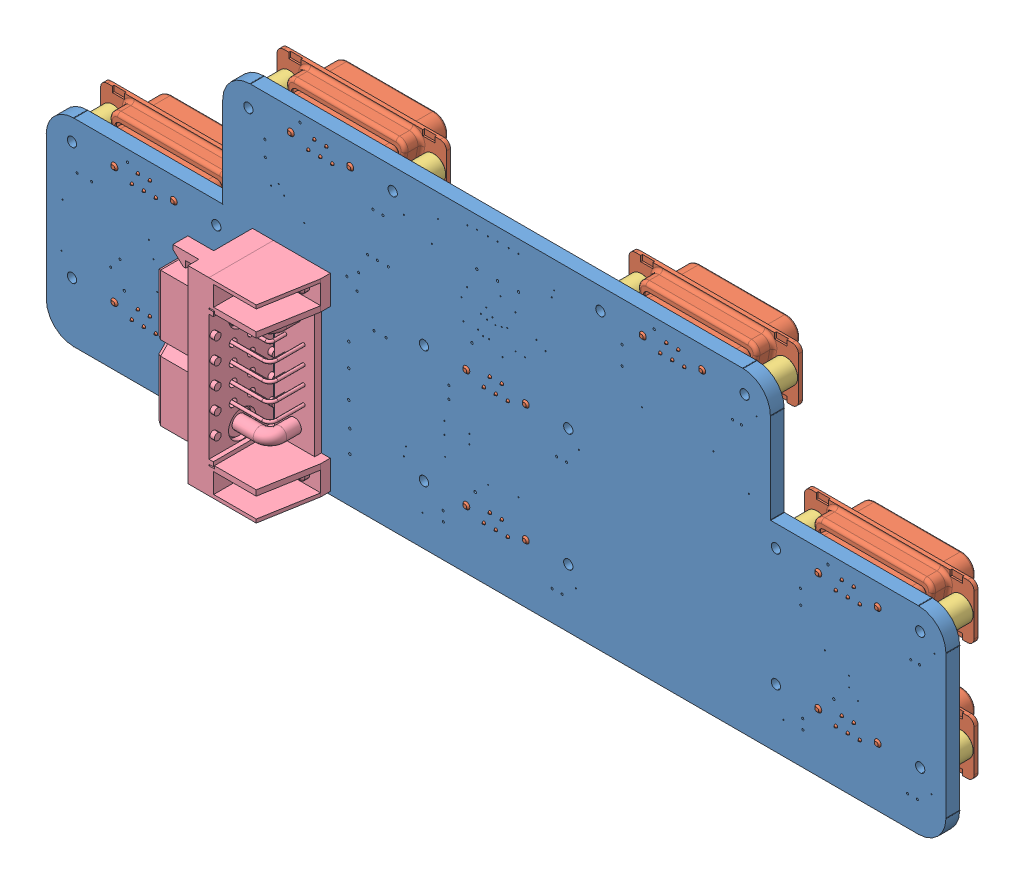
SolidWorks assembly Motherboard, 8 Cell, Version 26.SLDASM, configuration Default (file format 11000). Lengths in mm.
Overall size (207.9 74.26 31.39).
34 component instances, 4 part files, 27 mates.
Components (placement in the parent):
- INSPENG_8_PACK_CNTLR-26-1: INSPENG_8_PACK_CNTLR-26.SLDPRT [Default] at (-64.5951 59.0677 268.1952) size (207.9 73.05 3.17)
- CBD7W2 with SMT standoff-1: CBD7W2 with SMT standoff.SLDASM [Default] at (94.8661 218.5543 261.8452) x (0 1 0) z (-1 0 0) size (12.55 16.86 39.14)
  - CBD7W2M35S6000-1: CBD7W2M35S6000.SLDPRT [without posts] at origin size (12.55 16.86 39.14)
  - 20130118-183809-29217700-1: 20130118-183809-29217700.SLDPRT [Default] at (0 -7.874 16.6624) x (0 1 0) z (0 0 1) size (7.87 5.56 5.56)
  - 20130118-183809-29217700-2: 20130118-183809-29217700.SLDPRT [Default] at (0 -7.874 -16.6624) x (0 1 0) z (0 0 1) size (7.87 5.56 5.56)
- CBD7W2 with SMT standoff-2: CBD7W2 with SMT standoff.SLDASM [Default] at (176.1461 218.5543 261.8452) x (0 1 0) z (-1 0 0) size (12.55 16.86 39.14)
  - CBD7W2M35S6000-1: CBD7W2M35S6000.SLDPRT [without posts] at origin size (12.55 16.86 39.14)
  - 20130118-183809-29217700-1: 20130118-183809-29217700.SLDPRT [Default] at (0 -7.874 16.6624) x (0 1 0) z (0 0 1) size (7.87 5.56 5.56)
  - 20130118-183809-29217700-2: 20130118-183809-29217700.SLDPRT [Default] at (0 -7.874 -16.6624) x (0 1 0) z (0 0 1) size (7.87 5.56 5.56)
- CBD7W2 with SMT standoff-3: CBD7W2 with SMT standoff.SLDASM [Default] at (54.1245 191.3763 261.8452) x (0 1 0) z (-1 0 0) size (12.55 16.86 39.14)
  - CBD7W2M35S6000-1: CBD7W2M35S6000.SLDPRT [without posts] at origin size (12.55 16.86 39.14)
  - 20130118-183809-29217700-1: 20130118-183809-29217700.SLDPRT [Default] at (0 -7.874 16.6624) x (0 1 0) z (0 0 1) size (7.87 5.56 5.56)
  - 20130118-183809-29217700-2: 20130118-183809-29217700.SLDPRT [Default] at (0 -7.874 -16.6624) x (0 1 0) z (0 0 1) size (7.87 5.56 5.56)
- CBD7W2 with SMT standoff-4: CBD7W2 with SMT standoff.SLDASM [Default] at (135.4045 191.3763 261.8452) x (0 1 0) z (-1 0 0) size (12.55 16.86 39.14)
  - CBD7W2M35S6000-1: CBD7W2M35S6000.SLDPRT [without posts] at origin size (12.55 16.86 39.14)
  - 20130118-183809-29217700-1: 20130118-183809-29217700.SLDPRT [Default] at (0 -7.874 16.6624) x (0 1 0) z (0 0 1) size (7.87 5.56 5.56)
  - 20130118-183809-29217700-2: 20130118-183809-29217700.SLDPRT [Default] at (0 -7.874 -16.6624) x (0 1 0) z (0 0 1) size (7.87 5.56 5.56)
- CBD7W2 with SMT standoff-5: CBD7W2 with SMT standoff.SLDASM [Default] at (216.6845 191.3763 261.8452) x (0 1 0) z (-1 0 0) size (12.55 16.86 39.14)
  - CBD7W2M35S6000-1: CBD7W2M35S6000.SLDPRT [without posts] at origin size (12.55 16.86 39.14)
  - 20130118-183809-29217700-1: 20130118-183809-29217700.SLDPRT [Default] at (0 -7.874 16.6624) x (0 1 0) z (0 0 1) size (7.87 5.56 5.56)
  - 20130118-183809-29217700-2: 20130118-183809-29217700.SLDPRT [Default] at (0 -7.874 -16.6624) x (0 1 0) z (0 0 1) size (7.87 5.56 5.56)
- CBD7W2 with SMT standoff-6: CBD7W2 with SMT standoff.SLDASM [Default] at (216.6845 164.1983 261.8452) x (0 1 0) z (-1 0 0) size (12.55 16.86 39.14)
  - CBD7W2M35S6000-1: CBD7W2M35S6000.SLDPRT [without posts] at origin size (12.55 16.86 39.14)
  - 20130118-183809-29217700-1: 20130118-183809-29217700.SLDPRT [Default] at (0 -7.874 16.6624) x (0 1 0) z (0 0 1) size (7.87 5.56 5.56)
  - 20130118-183809-29217700-2: 20130118-183809-29217700.SLDPRT [Default] at (0 -7.874 -16.6624) x (0 1 0) z (0 0 1) size (7.87 5.56 5.56)
- CBD7W2 with SMT standoff-7: CBD7W2 with SMT standoff.SLDASM [Default] at (135.4045 164.1983 261.8452) x (0 1 0) z (-1 0 0) size (12.55 16.86 39.14)
  - CBD7W2M35S6000-1: CBD7W2M35S6000.SLDPRT [without posts] at origin size (12.55 16.86 39.14)
  - 20130118-183809-29217700-1: 20130118-183809-29217700.SLDPRT [Default] at (0 -7.874 16.6624) x (0 1 0) z (0 0 1) size (7.87 5.56 5.56)
  - 20130118-183809-29217700-2: 20130118-183809-29217700.SLDPRT [Default] at (0 -7.874 -16.6624) x (0 1 0) z (0 0 1) size (7.87 5.56 5.56)
- CBD7W2 with SMT standoff-8: CBD7W2 with SMT standoff.SLDASM [Default] at (54.1245 164.1983 261.8452) x (0 1 0) z (-1 0 0) size (12.55 16.86 39.14)
  - CBD7W2M35S6000-1: CBD7W2M35S6000.SLDPRT [without posts] at origin size (12.55 16.86 39.14)
  - 20130118-183809-29217700-1: 20130118-183809-29217700.SLDPRT [Default] at (0 -7.874 16.6624) x (0 1 0) z (0 0 1) size (7.87 5.56 5.56)
  - 20130118-183809-29217700-2: 20130118-183809-29217700.SLDPRT [Default] at (0 -7.874 -16.6624) x (0 1 0) z (0 0 1) size (7.87 5.56 5.56)
- PLB10W2F4B3N0A1-1: PLB10W2F4B3N0A1.SLDPRT [Default] at (79.1435 173.1137 270.8621) x (0 -1 0) z (-1 0 0) size (43.64 19.1 27.36)
Mates (geometry in assembly coordinates):
- Concentric1: concentric: cylinder of INSPENG_8_PACK_CNTLR-26-1 through (78.2037 218.5543 271.3702) axis (0 0 -1) radius 1.0731; cylinder of CBD7W2 with SMT standoff-1/20130118-183809-29217700-1 through (78.2037 218.5543 269.5147) axis (0 0 -1) radius 2.0447
- Concentric2: concentric: cylinder of INSPENG_8_PACK_CNTLR-26-1 through (111.5285 218.5543 271.3702) axis (0 0 -1) radius 1.0731; cylinder of CBD7W2 with SMT standoff-1/20130118-183809-29217700-2 through (111.5285 218.5543 269.5147) axis (0 0 -1) radius 2.0447
- Coincident1: coincident: plane of INSPENG_8_PACK_CNTLR-26-1 through (37.849 156.9653 268.1952) normal (0 0 -1); plane of CBD7W2 with SMT standoff-1/20130118-183809-29217700-2 through (114.2264 221.3062 268.1952) normal (0 0 1)
- Concentric3: concentric: cylinder of INSPENG_8_PACK_CNTLR-26-1 through (159.4837 218.5543 271.3702) axis (0 0 -1) radius 1.0731; cylinder of CBD7W2 with SMT standoff-2/20130118-183809-29217700-1 through (159.4837 218.5543 269.5147) axis (0 0 -1) radius 2.0447
- Concentric4: concentric: cylinder of INSPENG_8_PACK_CNTLR-26-1 through (192.8085 218.5543 271.3702) axis (0 0 -1) radius 1.0731; cylinder of CBD7W2 with SMT standoff-2/20130118-183809-29217700-2 through (192.8085 218.5543 269.5147) axis (0 0 -1) radius 2.0447
- Coincident2: coincident: plane of INSPENG_8_PACK_CNTLR-26-1 through (37.849 156.9653 268.1952) normal (0 0 -1); plane of CBD7W2 with SMT standoff-2/20130118-183809-29217700-1 through (162.1816 221.3062 268.1952) normal (0 0 1)
- Concentric5: concentric: cylinder of INSPENG_8_PACK_CNTLR-26-1 through (37.4621 191.3763 271.3702) axis (0 0 -1) radius 1.0731; cylinder of CBD7W2 with SMT standoff-3/20130118-183809-29217700-1 through (37.4621 191.3763 269.5147) axis (0 0 -1) radius 2.0447
- Concentric6: concentric: cylinder of INSPENG_8_PACK_CNTLR-26-1 through (70.7869 191.3763 271.3702) axis (0 0 -1) radius 1.0731; cylinder of CBD7W2 with SMT standoff-3/20130118-183809-29217700-2 through (70.7869 191.3763 267.3265) axis (0 0 -1) radius 2.7813
- Coincident3: coincident: plane of INSPENG_8_PACK_CNTLR-26-1 through (37.849 156.9653 268.1952) normal (0 0 -1); plane of CBD7W2 with SMT standoff-3/20130118-183809-29217700-1 through (40.16 194.1282 268.1952) normal (0 0 1)
- Concentric7: concentric: cylinder of INSPENG_8_PACK_CNTLR-26-1 through (118.7421 191.3763 271.3702) axis (0 0 -1) radius 1.0731; cylinder of CBD7W2 with SMT standoff-4/20130118-183809-29217700-1 through (118.7421 191.3763 267.3265) axis (0 0 -1) radius 2.7813
- Concentric8: concentric: cylinder of INSPENG_8_PACK_CNTLR-26-1 through (152.0669 191.3763 271.3702) axis (0 0 -1) radius 1.0731; cylinder of CBD7W2 with SMT standoff-4/20130118-183809-29217700-2 through (152.0669 191.3763 267.3265) axis (0 0 -1) radius 2.7813
- Coincident4: coincident: plane of INSPENG_8_PACK_CNTLR-26-1 through (37.849 156.9653 268.1952) normal (0 0 -1); plane of CBD7W2 with SMT standoff-4/20130118-183809-29217700-2 through (154.7648 194.1282 268.1952) normal (0 0 1)
- Concentric9: concentric: cylinder of INSPENG_8_PACK_CNTLR-26-1 through (200.0221 191.3763 271.3702) axis (0 0 -1) radius 1.0731; cylinder of CBD7W2 with SMT standoff-5/20130118-183809-29217700-1 through (200.0221 191.3763 267.3265) axis (0 0 -1) radius 2.7813
- Concentric10: concentric: cylinder of INSPENG_8_PACK_CNTLR-26-1 through (233.3469 191.3763 271.3702) axis (0 0 -1) radius 1.0731; cylinder of CBD7W2 with SMT standoff-5/20130118-183809-29217700-2 through (233.3469 191.3763 261.9925) axis (0 0 1) radius 1.4732
- Coincident5: coincident: plane of INSPENG_8_PACK_CNTLR-26-1 through (37.849 156.9653 268.1952) normal (0 0 -1); plane of CBD7W2 with SMT standoff-5/20130118-183809-29217700-2 through (236.0448 194.1282 268.1952) normal (0 0 1)
- Concentric11: concentric: cylinder of INSPENG_8_PACK_CNTLR-26-1 through (200.0221 164.1983 271.3702) axis (0 0 -1) radius 1.0731; cylinder of CBD7W2 with SMT standoff-6/20130118-183809-29217700-1 through (200.0221 164.1983 267.3265) axis (0 0 -1) radius 2.7813
- Concentric12: concentric: cylinder of INSPENG_8_PACK_CNTLR-26-1 through (233.3469 164.1983 271.3702) axis (0 0 -1) radius 1.0731; cylinder of CBD7W2 with SMT standoff-6/20130118-183809-29217700-2 through (233.3469 164.1983 267.3265) axis (0 0 -1) radius 2.7813
- Coincident6: coincident: plane of INSPENG_8_PACK_CNTLR-26-1 through (37.849 156.9653 268.1952) normal (0 0 -1); plane of CBD7W2 with SMT standoff-6/20130118-183809-29217700-2 through (236.0448 166.9502 268.1952) normal (0 0 1)
- Concentric13: concentric: cylinder of INSPENG_8_PACK_CNTLR-26-1 through (118.7421 164.1983 271.3702) axis (0 0 -1) radius 1.0731; cylinder of CBD7W2 with SMT standoff-7/20130118-183809-29217700-1 through (118.7421 164.1983 261.9925) axis (0 0 1) radius 1.4732
- Concentric14: concentric: cylinder of INSPENG_8_PACK_CNTLR-26-1 through (152.0669 164.1983 271.3702) axis (0 0 -1) radius 1.0731; cylinder of CBD7W2 with SMT standoff-7/20130118-183809-29217700-2 through (152.0669 164.1983 261.9925) axis (0 0 1) radius 1.4732
- Coincident7: coincident: plane of INSPENG_8_PACK_CNTLR-26-1 through (37.849 156.9653 268.1952) normal (0 0 -1); plane of CBD7W2 with SMT standoff-7/20130118-183809-29217700-2 through (154.7648 166.9502 268.1952) normal (0 0 1)
- Concentric15: concentric: cylinder of INSPENG_8_PACK_CNTLR-26-1 through (37.4621 164.1983 271.3702) axis (0 0 -1) radius 1.0731; cylinder of CBD7W2 with SMT standoff-8/20130118-183809-29217700-1 through (37.4621 164.1983 261.9925) axis (0 0 1) radius 1.4732
- Concentric16: concentric: cylinder of INSPENG_8_PACK_CNTLR-26-1 through (70.7869 164.1983 271.3702) axis (0 0 -1) radius 1.0731; cylinder of CBD7W2 with SMT standoff-8/20130118-183809-29217700-2 through (70.7869 164.1983 261.9925) axis (0 0 1) radius 1.4732
- Coincident8: coincident: plane of INSPENG_8_PACK_CNTLR-26-1 through (37.849 156.9653 268.1952) normal (0 0 -1); plane of CBD7W2 with SMT standoff-8/20130118-183809-29217700-2 through (73.4848 166.9502 268.1952) normal (0 0 1)
- Coincident9: coincident: plane of INSPENG_8_PACK_CNTLR-26-1 through (37.849 156.9653 271.3702) normal (0 0 1); plane of PLB10W2F4B3N0A1-1 through (85.7475 500173.1137 271.3702) normal (0 0 -1)
- Concentric17: concentric: cylinder of INSPENG_8_PACK_CNTLR-26-1 through (90.3703 161.9123 271.3702) axis (0 0 -1) radius 0.9208; cylinder of PLB10W2F4B3N0A1-1 through (90.3703 161.9123 276.2723) axis (0 0 -1) radius 1.5875
- Concentric18: concentric: cylinder of INSPENG_8_PACK_CNTLR-26-1 through (90.3703 184.3151 271.3702) axis (0 0 -1) radius 0.9208; cylinder of PLB10W2F4B3N0A1-1 through (90.3703 184.3151 276.2723) axis (0 0 -1) radius 1.5875
